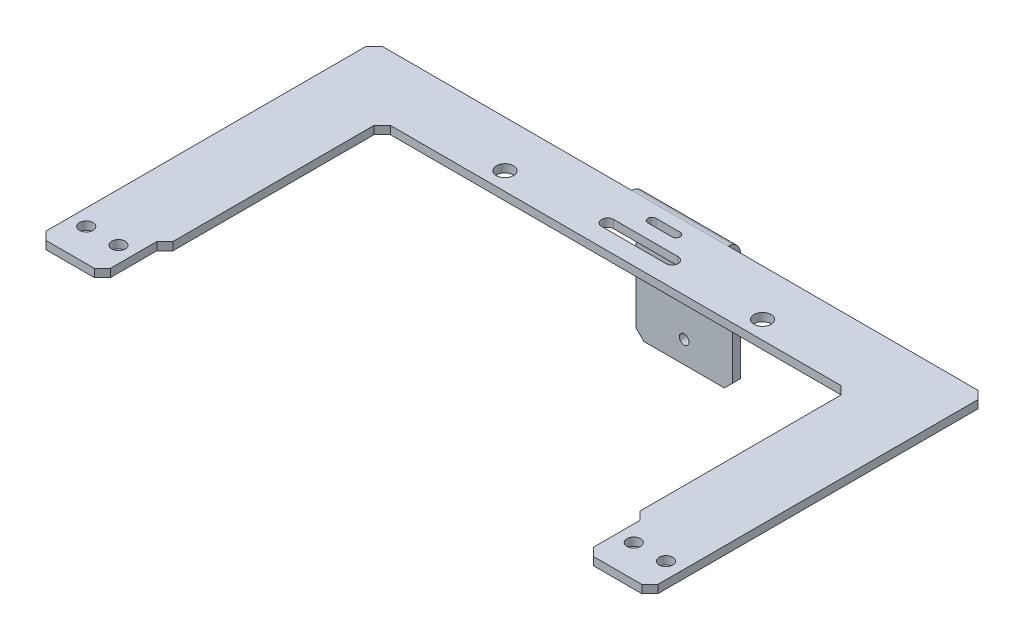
ISO-10303-21;
HEADER;
FILE_DESCRIPTION(('STEP AP214'),'2;1');
FILE_NAME('part.step','',(''),(''),'','','');
FILE_SCHEMA(('AUTOMOTIVE_DESIGN { 1 0 10303 214 1 1 1 1 }'));
ENDSEC;
DATA;
#1=APPLICATION_CONTEXT('core data for automotive mechanical design processes');
#2=APPLICATION_PROTOCOL_DEFINITION('international standard','automotive_design',2000,#1);
#3=PRODUCT_CONTEXT('',#1,'mechanical');
#4=PRODUCT('Part','Part','',(#3));
#5=PRODUCT_RELATED_PRODUCT_CATEGORY('part','',(#4));
#6=PRODUCT_DEFINITION_FORMATION('','',#4);
#7=PRODUCT_DEFINITION_CONTEXT('part definition',#1,'design');
#8=PRODUCT_DEFINITION('design','',#6,#7);
#9=PRODUCT_DEFINITION_SHAPE('','',#8);
#10=(LENGTH_UNIT() NAMED_UNIT(*) SI_UNIT(.MILLI.,.METRE.));
#11=(NAMED_UNIT(*) PLANE_ANGLE_UNIT() SI_UNIT($,.RADIAN.));
#12=(NAMED_UNIT(*) SI_UNIT($,.STERADIAN.) SOLID_ANGLE_UNIT());
#13=UNCERTAINTY_MEASURE_WITH_UNIT(LENGTH_MEASURE(1.E-05),#10,'distance_accuracy_value','');
#14=(GEOMETRIC_REPRESENTATION_CONTEXT(3) GLOBAL_UNCERTAINTY_ASSIGNED_CONTEXT((#13)) GLOBAL_UNIT_ASSIGNED_CONTEXT((#10,
#11,#12)) REPRESENTATION_CONTEXT('',''));
#15=CARTESIAN_POINT('',(0.,0.,0.));
#16=DIRECTION('',(0.,0.,1.));
#17=DIRECTION('',(1.,0.,0.));
#18=AXIS2_PLACEMENT_3D('',#15,#16,#17);
#19=CARTESIAN_POINT('',(0.,3.175,-132.588));
#20=DIRECTION('',(0.,0.,1.));
#21=DIRECTION('',(1.,0.,0.));
#22=AXIS2_PLACEMENT_3D('',#19,#20,#21);
#23=PLANE('',#22);
#24=DIRECTION('',(0.,1.,0.));
#25=VECTOR('',#24,1.);
#26=CARTESIAN_POINT('',(101.6,0.,-132.588));
#27=LINE('',#26,#25);
#28=CARTESIAN_POINT('',(101.6,0.,-132.588));
#29=VERTEX_POINT('',#28);
#30=CARTESIAN_POINT('',(101.6,3.175,-132.588));
#31=VERTEX_POINT('',#30);
#32=EDGE_CURVE('E688',#29,#31,#27,.T.);
#33=ORIENTED_EDGE('',*,*,#32,.F.);
#34=DIRECTION('',(-1.,0.,0.));
#35=VECTOR('',#34,1.);
#36=CARTESIAN_POINT('',(0.,0.,-132.588));
#37=LINE('',#36,#35);
#38=CARTESIAN_POINT('',(3.175,0.,-132.588));
#39=VERTEX_POINT('',#38);
#40=EDGE_CURVE('E27',#29,#39,#37,.T.);
#41=ORIENTED_EDGE('',*,*,#40,.T.);
#42=DIRECTION('',(0.,1.,0.));
#43=VECTOR('',#42,1.);
#44=CARTESIAN_POINT('',(3.175,3.175,-132.588));
#45=LINE('',#44,#43);
#46=CARTESIAN_POINT('',(3.175,3.175,-132.588));
#47=VERTEX_POINT('',#46);
#48=EDGE_CURVE('E704',#39,#47,#45,.T.);
#49=ORIENTED_EDGE('',*,*,#48,.T.);
#50=DIRECTION('',(-1.,0.,0.));
#51=VECTOR('',#50,1.);
#52=CARTESIAN_POINT('',(0.,3.175,-132.588));
#53=LINE('',#52,#51);
#54=EDGE_CURVE('E11',#31,#47,#53,.T.);
#55=ORIENTED_EDGE('',*,*,#54,.F.);
#56=EDGE_LOOP('',(#33,#41,#49,#55));
#57=FACE_BOUND('',#56,.T.);
#58=ADVANCED_FACE('F17',(#57),#23,.F.);
#59=CARTESIAN_POINT('',(0.,3.175,0.));
#60=DIRECTION('',(0.,-1.,0.));
#61=DIRECTION('',(0.,0.,-1.));
#62=AXIS2_PLACEMENT_3D('',#59,#60,#61);
#63=PLANE('',#62);
#64=DIRECTION('',(1.,0.,0.));
#65=VECTOR('',#64,1.);
#66=CARTESIAN_POINT('',(107.95,3.175,-114.33175));
#67=LINE('',#66,#65);
#68=CARTESIAN_POINT('',(107.95,3.175,-114.33175));
#69=VERTEX_POINT('',#68);
#70=CARTESIAN_POINT('',(133.35,3.175,-114.33175));
#71=VERTEX_POINT('',#70);
#72=EDGE_CURVE('E444',#69,#71,#67,.T.);
#73=ORIENTED_EDGE('',*,*,#72,.F.);
#74=CARTESIAN_POINT('',(107.95,3.175,-116.713));
#75=DIRECTION('',(0.,1.,0.));
#76=DIRECTION('',(0.,0.,1.));
#77=AXIS2_PLACEMENT_3D('',#74,#75,#76);
#78=CIRCLE('',#77,2.38125);
#79=CARTESIAN_POINT('',(107.95,3.175,-119.09425));
#80=VERTEX_POINT('',#79);
#81=EDGE_CURVE('E465',#80,#69,#78,.T.);
#82=ORIENTED_EDGE('',*,*,#81,.F.);
#83=DIRECTION('',(-1.,0.,0.));
#84=VECTOR('',#83,1.);
#85=CARTESIAN_POINT('',(107.95,3.175,-119.09425));
#86=LINE('',#85,#84);
#87=CARTESIAN_POINT('',(133.35,3.175,-119.09425));
#88=VERTEX_POINT('',#87);
#89=EDGE_CURVE('E457',#88,#80,#86,.T.);
#90=ORIENTED_EDGE('',*,*,#89,.F.);
#91=CARTESIAN_POINT('',(133.35,3.175,-116.713));
#92=DIRECTION('',(0.,1.,0.));
#93=DIRECTION('',(0.,0.,1.));
#94=AXIS2_PLACEMENT_3D('',#91,#92,#93);
#95=CIRCLE('',#94,2.38125);
#96=EDGE_CURVE('E504',#71,#88,#95,.T.);
#97=ORIENTED_EDGE('',*,*,#96,.F.);
#98=EDGE_LOOP('',(#73,#82,#90,#97));
#99=FACE_BOUND('',#98,.T.);
#100=DIRECTION('',(1.,0.,0.));
#101=VECTOR('',#100,1.);
#102=CARTESIAN_POINT('',(115.8875,3.175,-124.6505));
#103=LINE('',#102,#101);
#104=CARTESIAN_POINT('',(115.8875,3.175,-124.6505));
#105=VERTEX_POINT('',#104);
#106=CARTESIAN_POINT('',(125.4125,3.175,-124.6505));
#107=VERTEX_POINT('',#106);
#108=EDGE_CURVE('E397',#105,#107,#103,.T.);
#109=ORIENTED_EDGE('',*,*,#108,.F.);
#110=CARTESIAN_POINT('',(115.8875,3.175,-126.238));
#111=DIRECTION('',(0.,1.,0.));
#112=DIRECTION('',(0.,0.,1.));
#113=AXIS2_PLACEMENT_3D('',#110,#111,#112);
#114=CIRCLE('',#113,1.5875);
#115=CARTESIAN_POINT('',(115.8875,3.175,-127.8255));
#116=VERTEX_POINT('',#115);
#117=EDGE_CURVE('E599',#116,#105,#114,.T.);
#118=ORIENTED_EDGE('',*,*,#117,.F.);
#119=DIRECTION('',(-1.,0.,0.));
#120=VECTOR('',#119,1.);
#121=CARTESIAN_POINT('',(115.8875,3.175,-127.8255));
#122=LINE('',#121,#120);
#123=CARTESIAN_POINT('',(125.4125,3.175,-127.8255));
#124=VERTEX_POINT('',#123);
#125=EDGE_CURVE('E400',#124,#116,#122,.T.);
#126=ORIENTED_EDGE('',*,*,#125,.F.);
#127=CARTESIAN_POINT('',(125.4125,3.175,-126.238));
#128=DIRECTION('',(0.,1.,0.));
#129=DIRECTION('',(0.,0.,1.));
#130=AXIS2_PLACEMENT_3D('',#127,#128,#129);
#131=CIRCLE('',#130,1.5875);
#132=EDGE_CURVE('E394',#107,#124,#131,.T.);
#133=ORIENTED_EDGE('',*,*,#132,.F.);
#134=EDGE_LOOP('',(#109,#118,#126,#133));
#135=FACE_BOUND('',#134,.T.);
#136=DIRECTION('',(0.,0.,-1.));
#137=VECTOR('',#136,1.);
#138=CARTESIAN_POINT('',(241.3,3.175,0.));
#139=LINE('',#138,#137);
#140=CARTESIAN_POINT('',(241.3,3.175,-3.17500000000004));
#141=VERTEX_POINT('',#140);
#142=CARTESIAN_POINT('',(241.3,3.175,-129.413));
#143=VERTEX_POINT('',#142);
#144=EDGE_CURVE('E550',#141,#143,#139,.T.);
#145=ORIENTED_EDGE('',*,*,#144,.T.);
#146=DIRECTION('',(-0.707106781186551,0.,-0.707106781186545));
#147=VECTOR('',#146,1.);
#148=CARTESIAN_POINT('',(238.125,3.175,-132.588));
#149=LINE('',#148,#147);
#150=CARTESIAN_POINT('',(238.125,3.175,-132.588));
#151=VERTEX_POINT('',#150);
#152=EDGE_CURVE('E712',#143,#151,#149,.T.);
#153=ORIENTED_EDGE('',*,*,#152,.T.);
#154=DIRECTION('',(-1.,0.,0.));
#155=VECTOR('',#154,1.);
#156=CARTESIAN_POINT('',(0.,3.175,-132.588));
#157=LINE('',#156,#155);
#158=CARTESIAN_POINT('',(139.7,3.175,-132.588));
#159=VERTEX_POINT('',#158);
#160=EDGE_CURVE('E814',#151,#159,#157,.T.);
#161=ORIENTED_EDGE('',*,*,#160,.T.);
#162=DIRECTION('',(-1.,0.,0.));
#163=VECTOR('',#162,1.);
#164=CARTESIAN_POINT('',(139.7,3.175,-132.588));
#165=LINE('',#164,#163);
#166=EDGE_CURVE('E678',#159,#31,#165,.T.);
#167=ORIENTED_EDGE('',*,*,#166,.T.);
#168=ORIENTED_EDGE('',*,*,#54,.T.);
#169=DIRECTION('',(-0.707106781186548,0.,0.707106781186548));
#170=VECTOR('',#169,1.);
#171=CARTESIAN_POINT('',(0.,3.175,-129.413));
#172=LINE('',#171,#170);
#173=CARTESIAN_POINT('',(0.,3.175,-129.413));
#174=VERTEX_POINT('',#173);
#175=EDGE_CURVE('E692',#47,#174,#172,.T.);
#176=ORIENTED_EDGE('',*,*,#175,.T.);
#177=DIRECTION('',(0.,0.,1.));
#178=VECTOR('',#177,1.);
#179=CARTESIAN_POINT('',(0.,3.175,0.));
#180=LINE('',#179,#178);
#181=CARTESIAN_POINT('',(0.,3.175,-3.175));
#182=VERTEX_POINT('',#181);
#183=EDGE_CURVE('E695',#174,#182,#180,.T.);
#184=ORIENTED_EDGE('',*,*,#183,.T.);
#185=DIRECTION('',(0.707106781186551,0.,0.707106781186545));
#186=VECTOR('',#185,1.);
#187=CARTESIAN_POINT('',(3.17500000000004,3.175,0.));
#188=LINE('',#187,#186);
#189=CARTESIAN_POINT('',(3.17500000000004,3.175,0.));
#190=VERTEX_POINT('',#189);
#191=EDGE_CURVE('E725',#182,#190,#188,.T.);
#192=ORIENTED_EDGE('',*,*,#191,.T.);
#193=DIRECTION('',(1.,0.,0.));
#194=VECTOR('',#193,1.);
#195=CARTESIAN_POINT('',(25.4,3.175,0.));
#196=LINE('',#195,#194);
#197=CARTESIAN_POINT('',(22.225,3.175,0.));
#198=VERTEX_POINT('',#197);
#199=EDGE_CURVE('E746',#190,#198,#196,.T.);
#200=ORIENTED_EDGE('',*,*,#199,.T.);
#201=DIRECTION('',(0.707106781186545,0.,-0.707106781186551));
#202=VECTOR('',#201,1.);
#203=CARTESIAN_POINT('',(25.4,3.175,-3.17500000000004));
#204=LINE('',#203,#202);
#205=CARTESIAN_POINT('',(25.4,3.175,-3.17500000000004));
#206=VERTEX_POINT('',#205);
#207=EDGE_CURVE('E430',#198,#206,#204,.T.);
#208=ORIENTED_EDGE('',*,*,#207,.T.);
#209=DIRECTION('',(0.,0.,-1.));
#210=VECTOR('',#209,1.);
#211=CARTESIAN_POINT('',(25.4,3.175,0.));
#212=LINE('',#211,#210);
#213=CARTESIAN_POINT('',(25.4,3.175,-21.463));
#214=VERTEX_POINT('',#213);
#215=EDGE_CURVE('E40',#206,#214,#212,.T.);
#216=ORIENTED_EDGE('',*,*,#215,.T.);
#217=DIRECTION('',(0.707106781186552,0.,-0.707106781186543));
#218=VECTOR('',#217,1.);
#219=CARTESIAN_POINT('',(25.4,3.175,-21.463));
#220=LINE('',#219,#218);
#221=CARTESIAN_POINT('',(28.575,3.175,-24.638));
#222=VERTEX_POINT('',#221);
#223=EDGE_CURVE('E545',#214,#222,#220,.T.);
#224=ORIENTED_EDGE('',*,*,#223,.T.);
#225=DIRECTION('',(0.,0.,-1.));
#226=VECTOR('',#225,1.);
#227=CARTESIAN_POINT('',(28.575,3.175,-24.638));
#228=LINE('',#227,#226);
#229=CARTESIAN_POINT('',(28.575,3.175,-104.013));
#230=VERTEX_POINT('',#229);
#231=EDGE_CURVE('E759',#222,#230,#228,.T.);
#232=ORIENTED_EDGE('',*,*,#231,.T.);
#233=DIRECTION('',(0.707106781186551,0.,-0.707106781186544));
#234=VECTOR('',#233,1.);
#235=CARTESIAN_POINT('',(-37.719,3.175,-37.7190000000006));
#236=LINE('',#235,#234);
#237=CARTESIAN_POINT('',(31.75,3.175,-107.188));
#238=VERTEX_POINT('',#237);
#239=EDGE_CURVE('E516',#230,#238,#236,.T.);
#240=ORIENTED_EDGE('',*,*,#239,.T.);
#241=DIRECTION('',(1.,0.,0.));
#242=VECTOR('',#241,1.);
#243=CARTESIAN_POINT('',(28.575,3.175,-107.188));
#244=LINE('',#243,#242);
#245=CARTESIAN_POINT('',(209.55,3.175,-107.188));
#246=VERTEX_POINT('',#245);
#247=EDGE_CURVE('E469',#238,#246,#244,.T.);
#248=ORIENTED_EDGE('',*,*,#247,.T.);
#249=DIRECTION('',(0.707106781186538,0.,0.707106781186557));
#250=VECTOR('',#249,1.);
#251=CARTESIAN_POINT('',(158.369000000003,3.175,-158.369));
#252=LINE('',#251,#250);
#253=CARTESIAN_POINT('',(212.725,3.175,-104.013));
#254=VERTEX_POINT('',#253);
#255=EDGE_CURVE('E721',#246,#254,#252,.T.);
#256=ORIENTED_EDGE('',*,*,#255,.T.);
#257=DIRECTION('',(0.,0.,1.));
#258=VECTOR('',#257,1.);
#259=CARTESIAN_POINT('',(212.725,3.175,-24.638));
#260=LINE('',#259,#258);
#261=CARTESIAN_POINT('',(212.725,3.175,-24.638));
#262=VERTEX_POINT('',#261);
#263=EDGE_CURVE('E573',#254,#262,#260,.T.);
#264=ORIENTED_EDGE('',*,*,#263,.T.);
#265=DIRECTION('',(0.70710678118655,0.,0.707106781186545));
#266=VECTOR('',#265,1.);
#267=CARTESIAN_POINT('',(215.9,3.175,-21.463));
#268=LINE('',#267,#266);
#269=CARTESIAN_POINT('',(215.9,3.175,-21.463));
#270=VERTEX_POINT('',#269);
#271=EDGE_CURVE('E494',#262,#270,#268,.T.);
#272=ORIENTED_EDGE('',*,*,#271,.T.);
#273=DIRECTION('',(0.,0.,1.));
#274=VECTOR('',#273,1.);
#275=CARTESIAN_POINT('',(215.9,3.175,0.));
#276=LINE('',#275,#274);
#277=CARTESIAN_POINT('',(215.9,3.175,-3.175));
#278=VERTEX_POINT('',#277);
#279=EDGE_CURVE('E578',#270,#278,#276,.T.);
#280=ORIENTED_EDGE('',*,*,#279,.T.);
#281=DIRECTION('',(0.707106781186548,0.,0.707106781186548));
#282=VECTOR('',#281,1.);
#283=CARTESIAN_POINT('',(219.075,3.175,0.));
#284=LINE('',#283,#282);
#285=CARTESIAN_POINT('',(219.075,3.175,0.));
#286=VERTEX_POINT('',#285);
#287=EDGE_CURVE('E670',#278,#286,#284,.T.);
#288=ORIENTED_EDGE('',*,*,#287,.T.);
#289=DIRECTION('',(1.,0.,0.));
#290=VECTOR('',#289,1.);
#291=CARTESIAN_POINT('',(215.9,3.175,0.));
#292=LINE('',#291,#290);
#293=CARTESIAN_POINT('',(238.125,3.175,0.));
#294=VERTEX_POINT('',#293);
#295=EDGE_CURVE('E446',#286,#294,#292,.T.);
#296=ORIENTED_EDGE('',*,*,#295,.T.);
#297=DIRECTION('',(0.707106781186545,0.,-0.707106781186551));
#298=VECTOR('',#297,1.);
#299=CARTESIAN_POINT('',(241.3,3.175,-3.17500000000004));
#300=LINE('',#299,#298);
#301=EDGE_CURVE('E591',#294,#141,#300,.T.);
#302=ORIENTED_EDGE('',*,*,#301,.T.);
#303=EDGE_LOOP('',(#145,#153,#161,#167,#168,#176,#184,#192,#200,#208,#216,#224,#232,#240,#248,
#256,#264,#272,#280,#288,#296,#302));
#304=FACE_BOUND('',#303,.T.);
#305=CARTESIAN_POINT('',(6.35,3.175,-12.7));
#306=DIRECTION('',(0.,1.,0.));
#307=DIRECTION('',(0.,0.,1.));
#308=AXIS2_PLACEMENT_3D('',#305,#306,#307);
#309=CIRCLE('',#308,2.667);
#310=CARTESIAN_POINT('',(6.35,3.175,-10.033));
#311=VERTEX_POINT('',#310);
#312=EDGE_CURVE('E557',#311,#311,#309,.T.);
#313=ORIENTED_EDGE('',*,*,#312,.F.);
#314=EDGE_LOOP('',(#313));
#315=FACE_BOUND('',#314,.T.);
#316=CARTESIAN_POINT('',(19.05,3.175,-12.7));
#317=DIRECTION('',(0.,1.,0.));
#318=DIRECTION('',(0.,0.,1.));
#319=AXIS2_PLACEMENT_3D('',#316,#317,#318);
#320=CIRCLE('',#319,2.667);
#321=CARTESIAN_POINT('',(19.05,3.175,-10.033));
#322=VERTEX_POINT('',#321);
#323=EDGE_CURVE('E558',#322,#322,#320,.T.);
#324=ORIENTED_EDGE('',*,*,#323,.F.);
#325=EDGE_LOOP('',(#324));
#326=FACE_BOUND('',#325,.T.);
#327=CARTESIAN_POINT('',(69.85,3.175,-114.3));
#328=DIRECTION('',(0.,1.,0.));
#329=DIRECTION('',(0.,0.,1.));
#330=AXIS2_PLACEMENT_3D('',#327,#328,#329);
#331=CIRCLE('',#330,3.3782);
#332=CARTESIAN_POINT('',(69.85,3.175,-110.9218));
#333=VERTEX_POINT('',#332);
#334=EDGE_CURVE('E476',#333,#333,#331,.T.);
#335=ORIENTED_EDGE('',*,*,#334,.F.);
#336=EDGE_LOOP('',(#335));
#337=FACE_BOUND('',#336,.T.);
#338=CARTESIAN_POINT('',(222.25,3.175,-12.7));
#339=DIRECTION('',(0.,1.,0.));
#340=DIRECTION('',(0.,0.,-1.));
#341=AXIS2_PLACEMENT_3D('',#338,#339,#340);
#342=CIRCLE('',#341,2.667);
#343=CARTESIAN_POINT('',(222.25,3.175,-15.367));
#344=VERTEX_POINT('',#343);
#345=EDGE_CURVE('E659',#344,#344,#342,.T.);
#346=ORIENTED_EDGE('',*,*,#345,.F.);
#347=EDGE_LOOP('',(#346));
#348=FACE_BOUND('',#347,.T.);
#349=CARTESIAN_POINT('',(234.95,3.175,-12.7));
#350=DIRECTION('',(0.,1.,0.));
#351=DIRECTION('',(0.,0.,-1.));
#352=AXIS2_PLACEMENT_3D('',#349,#350,#351);
#353=CIRCLE('',#352,2.667);
#354=CARTESIAN_POINT('',(234.95,3.175,-15.367));
#355=VERTEX_POINT('',#354);
#356=EDGE_CURVE('E797',#355,#355,#353,.T.);
#357=ORIENTED_EDGE('',*,*,#356,.F.);
#358=EDGE_LOOP('',(#357));
#359=FACE_BOUND('',#358,.T.);
#360=CARTESIAN_POINT('',(171.45,3.175,-114.3));
#361=DIRECTION('',(0.,1.,0.));
#362=DIRECTION('',(0.,0.,-1.));
#363=AXIS2_PLACEMENT_3D('',#360,#361,#362);
#364=CIRCLE('',#363,3.3782);
#365=CARTESIAN_POINT('',(171.45,3.175,-117.6782));
#366=VERTEX_POINT('',#365);
#367=EDGE_CURVE('E652',#366,#366,#364,.T.);
#368=ORIENTED_EDGE('',*,*,#367,.F.);
#369=EDGE_LOOP('',(#368));
#370=FACE_BOUND('',#369,.T.);
#371=ADVANCED_FACE('F19',(#99,#135,#304,#315,#326,#337,#348,#359,#370),#63,.F.);
#372=CARTESIAN_POINT('',(0.,0.,0.));
#373=DIRECTION('',(0.,-1.,0.));
#374=DIRECTION('',(0.,0.,-1.));
#375=AXIS2_PLACEMENT_3D('',#372,#373,#374);
#376=PLANE('',#375);
#377=CARTESIAN_POINT('',(107.95,0.,-116.713));
#378=DIRECTION('',(0.,-1.,0.));
#379=DIRECTION('',(0.,0.,-1.));
#380=AXIS2_PLACEMENT_3D('',#377,#378,#379);
#381=CIRCLE('',#380,2.38125);
#382=CARTESIAN_POINT('',(107.95,0.,-114.33175));
#383=VERTEX_POINT('',#382);
#384=CARTESIAN_POINT('',(107.95,0.,-119.09425));
#385=VERTEX_POINT('',#384);
#386=EDGE_CURVE('E474',#383,#385,#381,.T.);
#387=ORIENTED_EDGE('',*,*,#386,.F.);
#388=DIRECTION('',(-1.,0.,0.));
#389=VECTOR('',#388,1.);
#390=CARTESIAN_POINT('',(0.,0.,-114.33175));
#391=LINE('',#390,#389);
#392=CARTESIAN_POINT('',(133.35,0.,-114.33175));
#393=VERTEX_POINT('',#392);
#394=EDGE_CURVE('E445',#393,#383,#391,.T.);
#395=ORIENTED_EDGE('',*,*,#394,.F.);
#396=CARTESIAN_POINT('',(133.35,0.,-116.713));
#397=DIRECTION('',(0.,-1.,0.));
#398=DIRECTION('',(0.,0.,-1.));
#399=AXIS2_PLACEMENT_3D('',#396,#397,#398);
#400=CIRCLE('',#399,2.38125);
#401=CARTESIAN_POINT('',(133.35,0.,-119.09425));
#402=VERTEX_POINT('',#401);
#403=EDGE_CURVE('E490',#402,#393,#400,.T.);
#404=ORIENTED_EDGE('',*,*,#403,.F.);
#405=DIRECTION('',(1.,0.,0.));
#406=VECTOR('',#405,1.);
#407=CARTESIAN_POINT('',(0.,0.,-119.09425));
#408=LINE('',#407,#406);
#409=EDGE_CURVE('E454',#385,#402,#408,.T.);
#410=ORIENTED_EDGE('',*,*,#409,.F.);
#411=EDGE_LOOP('',(#387,#395,#404,#410));
#412=FACE_BOUND('',#411,.T.);
#413=CARTESIAN_POINT('',(115.8875,0.,-126.238));
#414=DIRECTION('',(0.,-1.,0.));
#415=DIRECTION('',(0.,0.,-1.));
#416=AXIS2_PLACEMENT_3D('',#413,#414,#415);
#417=CIRCLE('',#416,1.5875);
#418=CARTESIAN_POINT('',(115.8875,0.,-124.6505));
#419=VERTEX_POINT('',#418);
#420=CARTESIAN_POINT('',(115.8875,0.,-127.8255));
#421=VERTEX_POINT('',#420);
#422=EDGE_CURVE('E590',#419,#421,#417,.T.);
#423=ORIENTED_EDGE('',*,*,#422,.F.);
#424=DIRECTION('',(-1.,0.,0.));
#425=VECTOR('',#424,1.);
#426=CARTESIAN_POINT('',(0.,0.,-124.6505));
#427=LINE('',#426,#425);
#428=CARTESIAN_POINT('',(125.4125,0.,-124.6505));
#429=VERTEX_POINT('',#428);
#430=EDGE_CURVE('E426',#429,#419,#427,.T.);
#431=ORIENTED_EDGE('',*,*,#430,.F.);
#432=CARTESIAN_POINT('',(125.4125,0.,-126.238));
#433=DIRECTION('',(0.,-1.,0.));
#434=DIRECTION('',(0.,0.,-1.));
#435=AXIS2_PLACEMENT_3D('',#432,#433,#434);
#436=CIRCLE('',#435,1.5875);
#437=CARTESIAN_POINT('',(125.4125,0.,-127.8255));
#438=VERTEX_POINT('',#437);
#439=EDGE_CURVE('E406',#438,#429,#436,.T.);
#440=ORIENTED_EDGE('',*,*,#439,.F.);
#441=DIRECTION('',(1.,0.,0.));
#442=VECTOR('',#441,1.);
#443=CARTESIAN_POINT('',(0.,0.,-127.8255));
#444=LINE('',#443,#442);
#445=EDGE_CURVE('E567',#421,#438,#444,.T.);
#446=ORIENTED_EDGE('',*,*,#445,.F.);
#447=EDGE_LOOP('',(#423,#431,#440,#446));
#448=FACE_BOUND('',#447,.T.);
#449=CARTESIAN_POINT('',(234.95,0.,-12.7));
#450=DIRECTION('',(0.,1.,0.));
#451=DIRECTION('',(0.,0.,-1.));
#452=AXIS2_PLACEMENT_3D('',#449,#450,#451);
#453=CIRCLE('',#452,2.667);
#454=CARTESIAN_POINT('',(234.95,0.,-15.367));
#455=VERTEX_POINT('',#454);
#456=EDGE_CURVE('E778',#455,#455,#453,.T.);
#457=ORIENTED_EDGE('',*,*,#456,.T.);
#458=EDGE_LOOP('',(#457));
#459=FACE_BOUND('',#458,.T.);
#460=CARTESIAN_POINT('',(69.85,0.,-114.3));
#461=DIRECTION('',(0.,1.,0.));
#462=DIRECTION('',(0.,0.,1.));
#463=AXIS2_PLACEMENT_3D('',#460,#461,#462);
#464=CIRCLE('',#463,3.3782);
#465=CARTESIAN_POINT('',(69.85,0.,-110.9218));
#466=VERTEX_POINT('',#465);
#467=EDGE_CURVE('E480',#466,#466,#464,.T.);
#468=ORIENTED_EDGE('',*,*,#467,.T.);
#469=EDGE_LOOP('',(#468));
#470=FACE_BOUND('',#469,.T.);
#471=CARTESIAN_POINT('',(6.35,0.,-12.7));
#472=DIRECTION('',(0.,1.,0.));
#473=DIRECTION('',(0.,0.,1.));
#474=AXIS2_PLACEMENT_3D('',#471,#472,#473);
#475=CIRCLE('',#474,2.667);
#476=CARTESIAN_POINT('',(6.35,0.,-10.033));
#477=VERTEX_POINT('',#476);
#478=EDGE_CURVE('E554',#477,#477,#475,.T.);
#479=ORIENTED_EDGE('',*,*,#478,.T.);
#480=EDGE_LOOP('',(#479));
#481=FACE_BOUND('',#480,.T.);
#482=DIRECTION('',(-1.,0.,0.));
#483=VECTOR('',#482,1.);
#484=CARTESIAN_POINT('',(0.,0.,-132.588));
#485=LINE('',#484,#483);
#486=CARTESIAN_POINT('',(238.125,0.,-132.588));
#487=VERTEX_POINT('',#486);
#488=CARTESIAN_POINT('',(139.7,0.,-132.588));
#489=VERTEX_POINT('',#488);
#490=EDGE_CURVE('E811',#487,#489,#485,.T.);
#491=ORIENTED_EDGE('',*,*,#490,.F.);
#492=DIRECTION('',(0.707106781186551,0.,0.707106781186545));
#493=VECTOR('',#492,1.);
#494=CARTESIAN_POINT('',(185.3565,0.,-185.3565));
#495=LINE('',#494,#493);
#496=CARTESIAN_POINT('',(241.3,0.,-129.413));
#497=VERTEX_POINT('',#496);
#498=EDGE_CURVE('E486',#487,#497,#495,.T.);
#499=ORIENTED_EDGE('',*,*,#498,.T.);
#500=DIRECTION('',(0.,0.,-1.));
#501=VECTOR('',#500,1.);
#502=CARTESIAN_POINT('',(241.3,0.,0.));
#503=LINE('',#502,#501);
#504=CARTESIAN_POINT('',(241.3,0.,-3.175));
#505=VERTEX_POINT('',#504);
#506=EDGE_CURVE('E553',#505,#497,#503,.T.);
#507=ORIENTED_EDGE('',*,*,#506,.F.);
#508=DIRECTION('',(-0.707106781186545,0.,0.707106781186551));
#509=VECTOR('',#508,1.);
#510=CARTESIAN_POINT('',(119.0625,0.,119.0625));
#511=LINE('',#510,#509);
#512=CARTESIAN_POINT('',(238.125,0.,0.));
#513=VERTEX_POINT('',#512);
#514=EDGE_CURVE('E696',#505,#513,#511,.T.);
#515=ORIENTED_EDGE('',*,*,#514,.T.);
#516=DIRECTION('',(1.,0.,0.));
#517=VECTOR('',#516,1.);
#518=CARTESIAN_POINT('',(215.9,0.,0.));
#519=LINE('',#518,#517);
#520=CARTESIAN_POINT('',(219.075,0.,0.));
#521=VERTEX_POINT('',#520);
#522=EDGE_CURVE('E450',#521,#513,#519,.T.);
#523=ORIENTED_EDGE('',*,*,#522,.F.);
#524=DIRECTION('',(-0.707106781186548,0.,-0.707106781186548));
#525=VECTOR('',#524,1.);
#526=CARTESIAN_POINT('',(109.5375,0.,-109.5375));
#527=LINE('',#526,#525);
#528=CARTESIAN_POINT('',(215.9,0.,-3.175));
#529=VERTEX_POINT('',#528);
#530=EDGE_CURVE('E782',#521,#529,#527,.T.);
#531=ORIENTED_EDGE('',*,*,#530,.T.);
#532=DIRECTION('',(0.,0.,1.));
#533=VECTOR('',#532,1.);
#534=CARTESIAN_POINT('',(215.9,0.,0.));
#535=LINE('',#534,#533);
#536=CARTESIAN_POINT('',(215.9,0.,-21.463));
#537=VERTEX_POINT('',#536);
#538=EDGE_CURVE('E449',#537,#529,#535,.T.);
#539=ORIENTED_EDGE('',*,*,#538,.F.);
#540=DIRECTION('',(0.70710678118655,0.,0.707106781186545));
#541=VECTOR('',#540,1.);
#542=CARTESIAN_POINT('',(215.9,0.,-21.463));
#543=LINE('',#542,#541);
#544=CARTESIAN_POINT('',(212.725,0.,-24.638));
#545=VERTEX_POINT('',#544);
#546=EDGE_CURVE('E491',#545,#537,#543,.T.);
#547=ORIENTED_EDGE('',*,*,#546,.F.);
#548=DIRECTION('',(0.,0.,1.));
#549=VECTOR('',#548,1.);
#550=CARTESIAN_POINT('',(212.725,0.,-24.638));
#551=LINE('',#550,#549);
#552=CARTESIAN_POINT('',(212.725,0.,-104.013));
#553=VERTEX_POINT('',#552);
#554=EDGE_CURVE('E470',#553,#545,#551,.T.);
#555=ORIENTED_EDGE('',*,*,#554,.F.);
#556=DIRECTION('',(-0.707106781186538,0.,-0.707106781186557));
#557=VECTOR('',#556,1.);
#558=CARTESIAN_POINT('',(212.725,0.,-104.013));
#559=LINE('',#558,#557);
#560=CARTESIAN_POINT('',(209.55,0.,-107.188));
#561=VERTEX_POINT('',#560);
#562=EDGE_CURVE('E671',#553,#561,#559,.T.);
#563=ORIENTED_EDGE('',*,*,#562,.T.);
#564=DIRECTION('',(1.,0.,0.));
#565=VECTOR('',#564,1.);
#566=CARTESIAN_POINT('',(28.575,0.,-107.188));
#567=LINE('',#566,#565);
#568=CARTESIAN_POINT('',(31.75,0.,-107.188));
#569=VERTEX_POINT('',#568);
#570=EDGE_CURVE('E466',#569,#561,#567,.T.);
#571=ORIENTED_EDGE('',*,*,#570,.F.);
#572=DIRECTION('',(-0.707106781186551,0.,0.707106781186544));
#573=VECTOR('',#572,1.);
#574=CARTESIAN_POINT('',(31.75,0.,-107.188));
#575=LINE('',#574,#573);
#576=CARTESIAN_POINT('',(28.575,0.,-104.013));
#577=VERTEX_POINT('',#576);
#578=EDGE_CURVE('E515',#569,#577,#575,.T.);
#579=ORIENTED_EDGE('',*,*,#578,.T.);
#580=DIRECTION('',(0.,0.,-1.));
#581=VECTOR('',#580,1.);
#582=CARTESIAN_POINT('',(28.575,0.,-24.638));
#583=LINE('',#582,#581);
#584=CARTESIAN_POINT('',(28.575,0.,-24.638));
#585=VERTEX_POINT('',#584);
#586=EDGE_CURVE('E771',#585,#577,#583,.T.);
#587=ORIENTED_EDGE('',*,*,#586,.F.);
#588=DIRECTION('',(0.707106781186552,0.,-0.707106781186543));
#589=VECTOR('',#588,1.);
#590=CARTESIAN_POINT('',(25.4,0.,-21.463));
#591=LINE('',#590,#589);
#592=CARTESIAN_POINT('',(25.4,0.,-21.463));
#593=VERTEX_POINT('',#592);
#594=EDGE_CURVE('E549',#593,#585,#591,.T.);
#595=ORIENTED_EDGE('',*,*,#594,.F.);
#596=DIRECTION('',(0.,0.,-1.));
#597=VECTOR('',#596,1.);
#598=CARTESIAN_POINT('',(25.4,0.,0.));
#599=LINE('',#598,#597);
#600=CARTESIAN_POINT('',(25.4,0.,-3.17500000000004));
#601=VERTEX_POINT('',#600);
#602=EDGE_CURVE('E49',#601,#593,#599,.T.);
#603=ORIENTED_EDGE('',*,*,#602,.F.);
#604=DIRECTION('',(-0.707106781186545,0.,0.707106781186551));
#605=VECTOR('',#604,1.);
#606=CARTESIAN_POINT('',(11.1125,0.,11.1125));
#607=LINE('',#606,#605);
#608=CARTESIAN_POINT('',(22.225,0.,0.));
#609=VERTEX_POINT('',#608);
#610=EDGE_CURVE('E537',#601,#609,#607,.T.);
#611=ORIENTED_EDGE('',*,*,#610,.T.);
#612=DIRECTION('',(1.,0.,0.));
#613=VECTOR('',#612,1.);
#614=CARTESIAN_POINT('',(25.4,0.,0.));
#615=LINE('',#614,#613);
#616=CARTESIAN_POINT('',(3.17500000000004,0.,0.));
#617=VERTEX_POINT('',#616);
#618=EDGE_CURVE('E614',#617,#609,#615,.T.);
#619=ORIENTED_EDGE('',*,*,#618,.F.);
#620=DIRECTION('',(-0.707106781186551,0.,-0.707106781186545));
#621=VECTOR('',#620,1.);
#622=CARTESIAN_POINT('',(1.5875,0.,-1.5875));
#623=LINE('',#622,#621);
#624=CARTESIAN_POINT('',(0.,0.,-3.175));
#625=VERTEX_POINT('',#624);
#626=EDGE_CURVE('E736',#617,#625,#623,.T.);
#627=ORIENTED_EDGE('',*,*,#626,.T.);
#628=DIRECTION('',(0.,0.,1.));
#629=VECTOR('',#628,1.);
#630=CARTESIAN_POINT('',(0.,0.,0.));
#631=LINE('',#630,#629);
#632=CARTESIAN_POINT('',(0.,0.,-129.413));
#633=VERTEX_POINT('',#632);
#634=EDGE_CURVE('E21',#633,#625,#631,.T.);
#635=ORIENTED_EDGE('',*,*,#634,.F.);
#636=DIRECTION('',(0.707106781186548,0.,-0.707106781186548));
#637=VECTOR('',#636,1.);
#638=CARTESIAN_POINT('',(-64.7065,0.,-64.7065));
#639=LINE('',#638,#637);
#640=EDGE_CURVE('E708',#633,#39,#639,.T.);
#641=ORIENTED_EDGE('',*,*,#640,.T.);
#642=ORIENTED_EDGE('',*,*,#40,.F.);
#643=DIRECTION('',(-1.,0.,0.));
#644=VECTOR('',#643,1.);
#645=CARTESIAN_POINT('',(139.7,0.,-132.588));
#646=LINE('',#645,#644);
#647=EDGE_CURVE('E559',#489,#29,#646,.T.);
#648=ORIENTED_EDGE('',*,*,#647,.F.);
#649=EDGE_LOOP('',(#491,#499,#507,#515,#523,#531,#539,#547,#555,#563,#571,#579,#587,#595,#603,
#611,#619,#627,#635,#641,#642,#648));
#650=FACE_BOUND('',#649,.T.);
#651=CARTESIAN_POINT('',(19.05,0.,-12.7));
#652=DIRECTION('',(0.,1.,0.));
#653=DIRECTION('',(0.,0.,1.));
#654=AXIS2_PLACEMENT_3D('',#651,#652,#653);
#655=CIRCLE('',#654,2.667);
#656=CARTESIAN_POINT('',(19.05,0.,-10.033));
#657=VERTEX_POINT('',#656);
#658=EDGE_CURVE('E479',#657,#657,#655,.T.);
#659=ORIENTED_EDGE('',*,*,#658,.T.);
#660=EDGE_LOOP('',(#659));
#661=FACE_BOUND('',#660,.T.);
#662=CARTESIAN_POINT('',(222.25,0.,-12.7));
#663=DIRECTION('',(0.,1.,0.));
#664=DIRECTION('',(0.,0.,-1.));
#665=AXIS2_PLACEMENT_3D('',#662,#663,#664);
#666=CIRCLE('',#665,2.667);
#667=CARTESIAN_POINT('',(222.25,0.,-15.367));
#668=VERTEX_POINT('',#667);
#669=EDGE_CURVE('E800',#668,#668,#666,.T.);
#670=ORIENTED_EDGE('',*,*,#669,.T.);
#671=EDGE_LOOP('',(#670));
#672=FACE_BOUND('',#671,.T.);
#673=CARTESIAN_POINT('',(171.45,0.,-114.3));
#674=DIRECTION('',(0.,1.,0.));
#675=DIRECTION('',(0.,0.,-1.));
#676=AXIS2_PLACEMENT_3D('',#673,#674,#675);
#677=CIRCLE('',#676,3.3782);
#678=CARTESIAN_POINT('',(171.45,0.,-117.6782));
#679=VERTEX_POINT('',#678);
#680=EDGE_CURVE('E485',#679,#679,#677,.T.);
#681=ORIENTED_EDGE('',*,*,#680,.T.);
#682=EDGE_LOOP('',(#681));
#683=FACE_BOUND('',#682,.T.);
#684=ADVANCED_FACE('F850',(#412,#448,#459,#470,#481,#650,#661,#672,#683),#376,.T.);
#685=CARTESIAN_POINT('',(0.,3.175,0.));
#686=DIRECTION('',(1.,0.,0.));
#687=DIRECTION('',(0.,1.,0.));
#688=AXIS2_PLACEMENT_3D('',#685,#686,#687);
#689=PLANE('',#688);
#690=ORIENTED_EDGE('',*,*,#634,.T.);
#691=DIRECTION('',(0.,1.,0.));
#692=VECTOR('',#691,1.);
#693=CARTESIAN_POINT('',(0.,3.175,-3.175));
#694=LINE('',#693,#692);
#695=EDGE_CURVE('E732',#625,#182,#694,.T.);
#696=ORIENTED_EDGE('',*,*,#695,.T.);
#697=ORIENTED_EDGE('',*,*,#183,.F.);
#698=DIRECTION('',(0.,-1.,0.));
#699=VECTOR('',#698,1.);
#700=CARTESIAN_POINT('',(0.,3.175,-129.413));
#701=LINE('',#700,#699);
#702=EDGE_CURVE('E716',#174,#633,#701,.T.);
#703=ORIENTED_EDGE('',*,*,#702,.T.);
#704=EDGE_LOOP('',(#690,#696,#697,#703));
#705=FACE_BOUND('',#704,.T.);
#706=ADVANCED_FACE('F843',(#705),#689,.F.);
#707=CARTESIAN_POINT('',(25.4,3.175,0.));
#708=DIRECTION('',(0.,0.,-1.));
#709=DIRECTION('',(0.,-1.,0.));
#710=AXIS2_PLACEMENT_3D('',#707,#708,#709);
#711=PLANE('',#710);
#712=ORIENTED_EDGE('',*,*,#618,.T.);
#713=DIRECTION('',(0.,1.,0.));
#714=VECTOR('',#713,1.);
#715=CARTESIAN_POINT('',(22.225,3.175,0.));
#716=LINE('',#715,#714);
#717=EDGE_CURVE('E432',#609,#198,#716,.T.);
#718=ORIENTED_EDGE('',*,*,#717,.T.);
#719=ORIENTED_EDGE('',*,*,#199,.F.);
#720=DIRECTION('',(0.,-1.,0.));
#721=VECTOR('',#720,1.);
#722=CARTESIAN_POINT('',(3.17500000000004,3.175,0.));
#723=LINE('',#722,#721);
#724=EDGE_CURVE('E433',#190,#617,#723,.T.);
#725=ORIENTED_EDGE('',*,*,#724,.T.);
#726=EDGE_LOOP('',(#712,#718,#719,#725));
#727=FACE_BOUND('',#726,.T.);
#728=ADVANCED_FACE('F943',(#727),#711,.F.);
#729=CARTESIAN_POINT('',(25.4,3.175,0.));
#730=DIRECTION('',(-1.,0.,0.));
#731=DIRECTION('',(0.,0.,1.));
#732=AXIS2_PLACEMENT_3D('',#729,#730,#731);
#733=PLANE('',#732);
#734=ORIENTED_EDGE('',*,*,#215,.F.);
#735=DIRECTION('',(0.,-1.,0.));
#736=VECTOR('',#735,1.);
#737=CARTESIAN_POINT('',(25.4,3.175,-3.17500000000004));
#738=LINE('',#737,#736);
#739=EDGE_CURVE('E740',#206,#601,#738,.T.);
#740=ORIENTED_EDGE('',*,*,#739,.T.);
#741=ORIENTED_EDGE('',*,*,#602,.T.);
#742=DIRECTION('',(0.,-1.,0.));
#743=VECTOR('',#742,1.);
#744=CARTESIAN_POINT('',(25.4,3.175,-21.463));
#745=LINE('',#744,#743);
#746=EDGE_CURVE('E548',#214,#593,#745,.T.);
#747=ORIENTED_EDGE('',*,*,#746,.F.);
#748=EDGE_LOOP('',(#734,#740,#741,#747));
#749=FACE_BOUND('',#748,.T.);
#750=ADVANCED_FACE('F935',(#749),#733,.F.);
#751=CARTESIAN_POINT('',(25.4,3.175,-21.463));
#752=DIRECTION('',(-0.707106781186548,0.,-0.707106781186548));
#753=DIRECTION('',(-0.707106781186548,0.,0.707106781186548));
#754=AXIS2_PLACEMENT_3D('',#751,#752,#753);
#755=PLANE('',#754);
#756=ORIENTED_EDGE('',*,*,#594,.T.);
#757=DIRECTION('',(0.,-1.,0.));
#758=VECTOR('',#757,1.);
#759=CARTESIAN_POINT('',(28.575,3.175,-24.638));
#760=LINE('',#759,#758);
#761=EDGE_CURVE('E755',#222,#585,#760,.T.);
#762=ORIENTED_EDGE('',*,*,#761,.F.);
#763=ORIENTED_EDGE('',*,*,#223,.F.);
#764=ORIENTED_EDGE('',*,*,#746,.T.);
#765=EDGE_LOOP('',(#756,#762,#763,#764));
#766=FACE_BOUND('',#765,.T.);
#767=ADVANCED_FACE('F933',(#766),#755,.F.);
#768=CARTESIAN_POINT('',(28.575,3.175,-24.638));
#769=DIRECTION('',(-1.,0.,0.));
#770=DIRECTION('',(0.,0.,1.));
#771=AXIS2_PLACEMENT_3D('',#768,#769,#770);
#772=PLANE('',#771);
#773=ORIENTED_EDGE('',*,*,#586,.T.);
#774=DIRECTION('',(0.,1.,0.));
#775=VECTOR('',#774,1.);
#776=CARTESIAN_POINT('',(28.575,3.175,-104.013));
#777=LINE('',#776,#775);
#778=EDGE_CURVE('E511',#577,#230,#777,.T.);
#779=ORIENTED_EDGE('',*,*,#778,.T.);
#780=ORIENTED_EDGE('',*,*,#231,.F.);
#781=ORIENTED_EDGE('',*,*,#761,.T.);
#782=EDGE_LOOP('',(#773,#779,#780,#781));
#783=FACE_BOUND('',#782,.T.);
#784=ADVANCED_FACE('F929',(#783),#772,.F.);
#785=CARTESIAN_POINT('',(28.575,3.175,-107.188));
#786=DIRECTION('',(0.,0.,-1.));
#787=DIRECTION('',(0.,-1.,0.));
#788=AXIS2_PLACEMENT_3D('',#785,#786,#787);
#789=PLANE('',#788);
#790=ORIENTED_EDGE('',*,*,#570,.T.);
#791=DIRECTION('',(0.,1.,0.));
#792=VECTOR('',#791,1.);
#793=CARTESIAN_POINT('',(209.55,3.175,-107.188));
#794=LINE('',#793,#792);
#795=EDGE_CURVE('E717',#561,#246,#794,.T.);
#796=ORIENTED_EDGE('',*,*,#795,.T.);
#797=ORIENTED_EDGE('',*,*,#247,.F.);
#798=DIRECTION('',(0.,-1.,0.));
#799=VECTOR('',#798,1.);
#800=CARTESIAN_POINT('',(31.75,0.,-107.188));
#801=LINE('',#800,#799);
#802=EDGE_CURVE('E641',#238,#569,#801,.T.);
#803=ORIENTED_EDGE('',*,*,#802,.T.);
#804=EDGE_LOOP('',(#790,#796,#797,#803));
#805=FACE_BOUND('',#804,.T.);
#806=ADVANCED_FACE('F923',(#805),#789,.F.);
#807=CARTESIAN_POINT('',(212.725,3.175,-24.638));
#808=DIRECTION('',(1.,0.,0.));
#809=DIRECTION('',(0.,1.,0.));
#810=AXIS2_PLACEMENT_3D('',#807,#808,#809);
#811=PLANE('',#810);
#812=ORIENTED_EDGE('',*,*,#263,.F.);
#813=DIRECTION('',(0.,-1.,0.));
#814=VECTOR('',#813,1.);
#815=CARTESIAN_POINT('',(212.725,0.,-104.013));
#816=LINE('',#815,#814);
#817=EDGE_CURVE('E666',#254,#553,#816,.T.);
#818=ORIENTED_EDGE('',*,*,#817,.T.);
#819=ORIENTED_EDGE('',*,*,#554,.T.);
#820=DIRECTION('',(0.,-1.,0.));
#821=VECTOR('',#820,1.);
#822=CARTESIAN_POINT('',(212.725,3.175,-24.638));
#823=LINE('',#822,#821);
#824=EDGE_CURVE('E569',#262,#545,#823,.T.);
#825=ORIENTED_EDGE('',*,*,#824,.F.);
#826=EDGE_LOOP('',(#812,#818,#819,#825));
#827=FACE_BOUND('',#826,.T.);
#828=ADVANCED_FACE('F911',(#827),#811,.F.);
#829=CARTESIAN_POINT('',(215.9,3.175,-21.463));
#830=DIRECTION('',(0.707106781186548,0.,-0.707106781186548));
#831=DIRECTION('',(0.,-1.,0.));
#832=AXIS2_PLACEMENT_3D('',#829,#830,#831);
#833=PLANE('',#832);
#834=ORIENTED_EDGE('',*,*,#546,.T.);
#835=DIRECTION('',(0.,-1.,0.));
#836=VECTOR('',#835,1.);
#837=CARTESIAN_POINT('',(215.9,3.175,-21.463));
#838=LINE('',#837,#836);
#839=EDGE_CURVE('E495',#270,#537,#838,.T.);
#840=ORIENTED_EDGE('',*,*,#839,.F.);
#841=ORIENTED_EDGE('',*,*,#271,.F.);
#842=ORIENTED_EDGE('',*,*,#824,.T.);
#843=EDGE_LOOP('',(#834,#840,#841,#842));
#844=FACE_BOUND('',#843,.T.);
#845=ADVANCED_FACE('F907',(#844),#833,.F.);
#846=CARTESIAN_POINT('',(215.9,3.175,0.));
#847=DIRECTION('',(1.,0.,0.));
#848=DIRECTION('',(0.,1.,0.));
#849=AXIS2_PLACEMENT_3D('',#846,#847,#848);
#850=PLANE('',#849);
#851=ORIENTED_EDGE('',*,*,#538,.T.);
#852=DIRECTION('',(0.,1.,0.));
#853=VECTOR('',#852,1.);
#854=CARTESIAN_POINT('',(215.9,3.175,-3.175));
#855=LINE('',#854,#853);
#856=EDGE_CURVE('E775',#529,#278,#855,.T.);
#857=ORIENTED_EDGE('',*,*,#856,.T.);
#858=ORIENTED_EDGE('',*,*,#279,.F.);
#859=ORIENTED_EDGE('',*,*,#839,.T.);
#860=EDGE_LOOP('',(#851,#857,#858,#859));
#861=FACE_BOUND('',#860,.T.);
#862=ADVANCED_FACE('F903',(#861),#850,.F.);
#863=CARTESIAN_POINT('',(25.4,3.175,0.));
#864=DIRECTION('',(0.,0.,-1.));
#865=DIRECTION('',(0.,-1.,0.));
#866=AXIS2_PLACEMENT_3D('',#863,#864,#865);
#867=PLANE('',#866);
#868=ORIENTED_EDGE('',*,*,#522,.T.);
#869=DIRECTION('',(0.,1.,0.));
#870=VECTOR('',#869,1.);
#871=CARTESIAN_POINT('',(238.125,3.175,0.));
#872=LINE('',#871,#870);
#873=EDGE_CURVE('E595',#513,#294,#872,.T.);
#874=ORIENTED_EDGE('',*,*,#873,.T.);
#875=ORIENTED_EDGE('',*,*,#295,.F.);
#876=DIRECTION('',(0.,-1.,0.));
#877=VECTOR('',#876,1.);
#878=CARTESIAN_POINT('',(219.075,3.175,0.));
#879=LINE('',#878,#877);
#880=EDGE_CURVE('E596',#286,#521,#879,.T.);
#881=ORIENTED_EDGE('',*,*,#880,.T.);
#882=EDGE_LOOP('',(#868,#874,#875,#881));
#883=FACE_BOUND('',#882,.T.);
#884=ADVANCED_FACE('F897',(#883),#867,.F.);
#885=CARTESIAN_POINT('',(241.3,3.175,0.));
#886=DIRECTION('',(-1.,0.,0.));
#887=DIRECTION('',(0.,0.,1.));
#888=AXIS2_PLACEMENT_3D('',#885,#886,#887);
#889=PLANE('',#888);
#890=ORIENTED_EDGE('',*,*,#506,.T.);
#891=DIRECTION('',(0.,1.,0.));
#892=VECTOR('',#891,1.);
#893=CARTESIAN_POINT('',(241.3,3.175,-129.413));
#894=LINE('',#893,#892);
#895=EDGE_CURVE('E582',#497,#143,#894,.T.);
#896=ORIENTED_EDGE('',*,*,#895,.T.);
#897=ORIENTED_EDGE('',*,*,#144,.F.);
#898=DIRECTION('',(0.,-1.,0.));
#899=VECTOR('',#898,1.);
#900=CARTESIAN_POINT('',(241.3,3.175,-3.17500000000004));
#901=LINE('',#900,#899);
#902=EDGE_CURVE('E700',#141,#505,#901,.T.);
#903=ORIENTED_EDGE('',*,*,#902,.T.);
#904=EDGE_LOOP('',(#890,#896,#897,#903));
#905=FACE_BOUND('',#904,.T.);
#906=ADVANCED_FACE('F885',(#905),#889,.F.);
#907=CARTESIAN_POINT('',(0.,3.175,-132.588));
#908=DIRECTION('',(0.,0.,1.));
#909=DIRECTION('',(1.,0.,0.));
#910=AXIS2_PLACEMENT_3D('',#907,#908,#909);
#911=PLANE('',#910);
#912=ORIENTED_EDGE('',*,*,#490,.T.);
#913=DIRECTION('',(0.,1.,0.));
#914=VECTOR('',#913,1.);
#915=CARTESIAN_POINT('',(139.7,0.,-132.588));
#916=LINE('',#915,#914);
#917=EDGE_CURVE('E542',#489,#159,#916,.T.);
#918=ORIENTED_EDGE('',*,*,#917,.T.);
#919=ORIENTED_EDGE('',*,*,#160,.F.);
#920=DIRECTION('',(0.,-1.,0.));
#921=VECTOR('',#920,1.);
#922=CARTESIAN_POINT('',(238.125,3.175,-132.588));
#923=LINE('',#922,#921);
#924=EDGE_CURVE('E481',#151,#487,#923,.T.);
#925=ORIENTED_EDGE('',*,*,#924,.T.);
#926=EDGE_LOOP('',(#912,#918,#919,#925));
#927=FACE_BOUND('',#926,.T.);
#928=ADVANCED_FACE('F877',(#927),#911,.F.);
#929=CARTESIAN_POINT('',(6.35,3.175,-12.7));
#930=DIRECTION('',(0.,-1.,0.));
#931=DIRECTION('',(0.,0.,-1.));
#932=AXIS2_PLACEMENT_3D('',#929,#930,#931);
#933=CYLINDRICAL_SURFACE('',#932,2.667);
#934=ORIENTED_EDGE('',*,*,#312,.T.);
#935=EDGE_LOOP('',(#934));
#936=FACE_BOUND('',#935,.T.);
#937=ORIENTED_EDGE('',*,*,#478,.F.);
#938=EDGE_LOOP('',(#937));
#939=FACE_BOUND('',#938,.T.);
#940=ADVANCED_FACE('F974',(#936,#939),#933,.F.);
#941=CARTESIAN_POINT('',(19.05,3.175,-12.7));
#942=DIRECTION('',(0.,-1.,0.));
#943=DIRECTION('',(0.,0.,-1.));
#944=AXIS2_PLACEMENT_3D('',#941,#942,#943);
#945=CYLINDRICAL_SURFACE('',#944,2.667);
#946=ORIENTED_EDGE('',*,*,#323,.T.);
#947=EDGE_LOOP('',(#946));
#948=FACE_BOUND('',#947,.T.);
#949=ORIENTED_EDGE('',*,*,#658,.F.);
#950=EDGE_LOOP('',(#949));
#951=FACE_BOUND('',#950,.T.);
#952=ADVANCED_FACE('F975',(#948,#951),#945,.F.);
#953=CARTESIAN_POINT('',(69.85,3.175,-114.3));
#954=DIRECTION('',(0.,-1.,0.));
#955=DIRECTION('',(0.,0.,-1.));
#956=AXIS2_PLACEMENT_3D('',#953,#954,#955);
#957=CYLINDRICAL_SURFACE('',#956,3.3782);
#958=ORIENTED_EDGE('',*,*,#334,.T.);
#959=EDGE_LOOP('',(#958));
#960=FACE_BOUND('',#959,.T.);
#961=ORIENTED_EDGE('',*,*,#467,.F.);
#962=EDGE_LOOP('',(#961));
#963=FACE_BOUND('',#962,.T.);
#964=ADVANCED_FACE('F978',(#960,#963),#957,.F.);
#965=CARTESIAN_POINT('',(222.25,3.175,-12.7));
#966=DIRECTION('',(0.,-1.,0.));
#967=DIRECTION('',(0.,0.,-1.));
#968=AXIS2_PLACEMENT_3D('',#965,#966,#967);
#969=CYLINDRICAL_SURFACE('',#968,2.667);
#970=ORIENTED_EDGE('',*,*,#345,.T.);
#971=EDGE_LOOP('',(#970));
#972=FACE_BOUND('',#971,.T.);
#973=ORIENTED_EDGE('',*,*,#669,.F.);
#974=EDGE_LOOP('',(#973));
#975=FACE_BOUND('',#974,.T.);
#976=ADVANCED_FACE('F982',(#972,#975),#969,.F.);
#977=CARTESIAN_POINT('',(234.95,3.175,-12.7));
#978=DIRECTION('',(0.,-1.,0.));
#979=DIRECTION('',(0.,0.,-1.));
#980=AXIS2_PLACEMENT_3D('',#977,#978,#979);
#981=CYLINDRICAL_SURFACE('',#980,2.667);
#982=ORIENTED_EDGE('',*,*,#356,.T.);
#983=EDGE_LOOP('',(#982));
#984=FACE_BOUND('',#983,.T.);
#985=ORIENTED_EDGE('',*,*,#456,.F.);
#986=EDGE_LOOP('',(#985));
#987=FACE_BOUND('',#986,.T.);
#988=ADVANCED_FACE('F986',(#984,#987),#981,.F.);
#989=CARTESIAN_POINT('',(171.45,3.175,-114.3));
#990=DIRECTION('',(0.,-1.,0.));
#991=DIRECTION('',(0.,0.,-1.));
#992=AXIS2_PLACEMENT_3D('',#989,#990,#991);
#993=CYLINDRICAL_SURFACE('',#992,3.3782);
#994=ORIENTED_EDGE('',*,*,#367,.T.);
#995=EDGE_LOOP('',(#994));
#996=FACE_BOUND('',#995,.T.);
#997=ORIENTED_EDGE('',*,*,#680,.F.);
#998=EDGE_LOOP('',(#997));
#999=FACE_BOUND('',#998,.T.);
#1000=ADVANCED_FACE('F990',(#996,#999),#993,.F.);
#1001=CARTESIAN_POINT('',(238.125,3.175,-132.588));
#1002=DIRECTION('',(-0.707106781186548,0.,0.707106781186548));
#1003=DIRECTION('',(0.,1.,0.));
#1004=AXIS2_PLACEMENT_3D('',#1001,#1002,#1003);
#1005=PLANE('',#1004);
#1006=ORIENTED_EDGE('',*,*,#152,.F.);
#1007=ORIENTED_EDGE('',*,*,#895,.F.);
#1008=ORIENTED_EDGE('',*,*,#498,.F.);
#1009=ORIENTED_EDGE('',*,*,#924,.F.);
#1010=EDGE_LOOP('',(#1006,#1007,#1008,#1009));
#1011=FACE_BOUND('',#1010,.T.);
#1012=ADVANCED_FACE('F883',(#1011),#1005,.F.);
#1013=CARTESIAN_POINT('',(241.3,3.175,-3.17500000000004));
#1014=DIRECTION('',(-0.707106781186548,0.,-0.707106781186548));
#1015=DIRECTION('',(-0.707106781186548,0.,0.707106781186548));
#1016=AXIS2_PLACEMENT_3D('',#1013,#1014,#1015);
#1017=PLANE('',#1016);
#1018=ORIENTED_EDGE('',*,*,#301,.F.);
#1019=ORIENTED_EDGE('',*,*,#873,.F.);
#1020=ORIENTED_EDGE('',*,*,#514,.F.);
#1021=ORIENTED_EDGE('',*,*,#902,.F.);
#1022=EDGE_LOOP('',(#1018,#1019,#1020,#1021));
#1023=FACE_BOUND('',#1022,.T.);
#1024=ADVANCED_FACE('F891',(#1023),#1017,.F.);
#1025=CARTESIAN_POINT('',(219.075,3.175,0.));
#1026=DIRECTION('',(0.707106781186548,0.,-0.707106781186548));
#1027=DIRECTION('',(0.,-1.,0.));
#1028=AXIS2_PLACEMENT_3D('',#1025,#1026,#1027);
#1029=PLANE('',#1028);
#1030=ORIENTED_EDGE('',*,*,#287,.F.);
#1031=ORIENTED_EDGE('',*,*,#856,.F.);
#1032=ORIENTED_EDGE('',*,*,#530,.F.);
#1033=ORIENTED_EDGE('',*,*,#880,.F.);
#1034=EDGE_LOOP('',(#1030,#1031,#1032,#1033));
#1035=FACE_BOUND('',#1034,.T.);
#1036=ADVANCED_FACE('F900',(#1035),#1029,.F.);
#1037=CARTESIAN_POINT('',(212.725,3.175,-104.013));
#1038=DIRECTION('',(-0.707106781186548,0.,0.707106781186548));
#1039=DIRECTION('',(0.,1.,0.));
#1040=AXIS2_PLACEMENT_3D('',#1037,#1038,#1039);
#1041=PLANE('',#1040);
#1042=ORIENTED_EDGE('',*,*,#255,.F.);
#1043=ORIENTED_EDGE('',*,*,#795,.F.);
#1044=ORIENTED_EDGE('',*,*,#562,.F.);
#1045=ORIENTED_EDGE('',*,*,#817,.F.);
#1046=EDGE_LOOP('',(#1042,#1043,#1044,#1045));
#1047=FACE_BOUND('',#1046,.T.);
#1048=ADVANCED_FACE('F917',(#1047),#1041,.T.);
#1049=CARTESIAN_POINT('',(31.75,3.175,-107.188));
#1050=DIRECTION('',(0.707106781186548,0.,0.707106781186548));
#1051=DIRECTION('',(0.,-1.,0.));
#1052=AXIS2_PLACEMENT_3D('',#1049,#1050,#1051);
#1053=PLANE('',#1052);
#1054=ORIENTED_EDGE('',*,*,#239,.F.);
#1055=ORIENTED_EDGE('',*,*,#778,.F.);
#1056=ORIENTED_EDGE('',*,*,#578,.F.);
#1057=ORIENTED_EDGE('',*,*,#802,.F.);
#1058=EDGE_LOOP('',(#1054,#1055,#1056,#1057));
#1059=FACE_BOUND('',#1058,.T.);
#1060=ADVANCED_FACE('F926',(#1059),#1053,.T.);
#1061=CARTESIAN_POINT('',(25.4,3.175,-3.17500000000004));
#1062=DIRECTION('',(-0.707106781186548,0.,-0.707106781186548));
#1063=DIRECTION('',(-0.707106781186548,0.,0.707106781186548));
#1064=AXIS2_PLACEMENT_3D('',#1061,#1062,#1063);
#1065=PLANE('',#1064);
#1066=ORIENTED_EDGE('',*,*,#207,.F.);
#1067=ORIENTED_EDGE('',*,*,#717,.F.);
#1068=ORIENTED_EDGE('',*,*,#610,.F.);
#1069=ORIENTED_EDGE('',*,*,#739,.F.);
#1070=EDGE_LOOP('',(#1066,#1067,#1068,#1069));
#1071=FACE_BOUND('',#1070,.T.);
#1072=ADVANCED_FACE('F940',(#1071),#1065,.F.);
#1073=CARTESIAN_POINT('',(3.17500000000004,3.175,0.));
#1074=DIRECTION('',(0.707106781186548,0.,-0.707106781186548));
#1075=DIRECTION('',(0.,-1.,0.));
#1076=AXIS2_PLACEMENT_3D('',#1073,#1074,#1075);
#1077=PLANE('',#1076);
#1078=ORIENTED_EDGE('',*,*,#191,.F.);
#1079=ORIENTED_EDGE('',*,*,#695,.F.);
#1080=ORIENTED_EDGE('',*,*,#626,.F.);
#1081=ORIENTED_EDGE('',*,*,#724,.F.);
#1082=EDGE_LOOP('',(#1078,#1079,#1080,#1081));
#1083=FACE_BOUND('',#1082,.T.);
#1084=ADVANCED_FACE('F854',(#1083),#1077,.F.);
#1085=CARTESIAN_POINT('',(0.,3.175,-129.413));
#1086=DIRECTION('',(0.707106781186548,0.,0.707106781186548));
#1087=DIRECTION('',(0.,-1.,0.));
#1088=AXIS2_PLACEMENT_3D('',#1085,#1086,#1087);
#1089=PLANE('',#1088);
#1090=ORIENTED_EDGE('',*,*,#175,.F.);
#1091=ORIENTED_EDGE('',*,*,#48,.F.);
#1092=ORIENTED_EDGE('',*,*,#640,.F.);
#1093=ORIENTED_EDGE('',*,*,#702,.F.);
#1094=EDGE_LOOP('',(#1090,#1091,#1092,#1093));
#1095=FACE_BOUND('',#1094,.T.);
#1096=ADVANCED_FACE('F858',(#1095),#1089,.F.);
#1097=CARTESIAN_POINT('',(101.6,0.,-137.3505));
#1098=DIRECTION('',(1.,0.,0.));
#1099=DIRECTION('',(0.,1.,0.));
#1100=AXIS2_PLACEMENT_3D('',#1097,#1098,#1099);
#1101=PLANE('',#1100);
#1102=CARTESIAN_POINT('',(101.6,-1.5875,-132.588));
#1103=DIRECTION('',(-1.,0.,0.));
#1104=DIRECTION('',(0.,0.,-1.));
#1105=AXIS2_PLACEMENT_3D('',#1102,#1103,#1104);
#1106=CIRCLE('',#1105,4.7625);
#1107=CARTESIAN_POINT('',(101.6,-1.5875,-137.3505));
#1108=VERTEX_POINT('',#1107);
#1109=EDGE_CURVE('E540',#31,#1108,#1106,.T.);
#1110=ORIENTED_EDGE('',*,*,#1109,.T.);
#1111=DIRECTION('',(0.,1.,0.));
#1112=VECTOR('',#1111,1.);
#1113=CARTESIAN_POINT('',(101.6,4.74714588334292E-13,-137.3505));
#1114=LINE('',#1113,#1112);
#1115=CARTESIAN_POINT('',(101.6,-44.45,-137.3505));
#1116=VERTEX_POINT('',#1115);
#1117=EDGE_CURVE('E523',#1116,#1108,#1114,.T.);
#1118=ORIENTED_EDGE('',*,*,#1117,.F.);
#1119=DIRECTION('',(0.,0.,1.));
#1120=VECTOR('',#1119,1.);
#1121=CARTESIAN_POINT('',(101.6,-44.45,-137.3505));
#1122=LINE('',#1121,#1120);
#1123=CARTESIAN_POINT('',(101.6,-44.45,-134.1755));
#1124=VERTEX_POINT('',#1123);
#1125=EDGE_CURVE('E438',#1116,#1124,#1122,.T.);
#1126=ORIENTED_EDGE('',*,*,#1125,.T.);
#1127=DIRECTION('',(0.,1.,0.));
#1128=VECTOR('',#1127,1.);
#1129=CARTESIAN_POINT('',(101.6,0.,-134.1755));
#1130=LINE('',#1129,#1128);
#1131=CARTESIAN_POINT('',(101.6,-1.5875,-134.1755));
#1132=VERTEX_POINT('',#1131);
#1133=EDGE_CURVE('E524',#1124,#1132,#1130,.T.);
#1134=ORIENTED_EDGE('',*,*,#1133,.T.);
#1135=CARTESIAN_POINT('',(101.6,-1.5875,-132.588));
#1136=DIRECTION('',(-1.,0.,0.));
#1137=DIRECTION('',(0.,0.,-1.));
#1138=AXIS2_PLACEMENT_3D('',#1135,#1136,#1137);
#1139=CIRCLE('',#1138,1.5875);
#1140=EDGE_CURVE('E563',#29,#1132,#1139,.T.);
#1141=ORIENTED_EDGE('',*,*,#1140,.F.);
#1142=ORIENTED_EDGE('',*,*,#32,.T.);
#1143=EDGE_LOOP('',(#1110,#1118,#1126,#1134,#1141,#1142));
#1144=FACE_BOUND('',#1143,.T.);
#1145=ADVANCED_FACE('F866',(#1144),#1101,.F.);
#1146=CARTESIAN_POINT('',(139.7,-47.625,-137.3505));
#1147=DIRECTION('',(-1.,0.,0.));
#1148=DIRECTION('',(0.,0.,1.));
#1149=AXIS2_PLACEMENT_3D('',#1146,#1147,#1148);
#1150=PLANE('',#1149);
#1151=CARTESIAN_POINT('',(139.7,-1.5875,-132.588));
#1152=DIRECTION('',(1.,0.,0.));
#1153=DIRECTION('',(0.,0.,-1.));
#1154=AXIS2_PLACEMENT_3D('',#1151,#1152,#1153);
#1155=CIRCLE('',#1154,1.5875);
#1156=CARTESIAN_POINT('',(139.7,-1.5875,-134.1755));
#1157=VERTEX_POINT('',#1156);
#1158=EDGE_CURVE('E617',#1157,#489,#1155,.T.);
#1159=ORIENTED_EDGE('',*,*,#1158,.F.);
#1160=DIRECTION('',(0.,-1.,0.));
#1161=VECTOR('',#1160,1.);
#1162=CARTESIAN_POINT('',(139.7,-47.625,-134.1755));
#1163=LINE('',#1162,#1161);
#1164=CARTESIAN_POINT('',(139.7,-44.45,-134.1755));
#1165=VERTEX_POINT('',#1164);
#1166=EDGE_CURVE('E618',#1157,#1165,#1163,.T.);
#1167=ORIENTED_EDGE('',*,*,#1166,.T.);
#1168=DIRECTION('',(0.,0.,-1.));
#1169=VECTOR('',#1168,1.);
#1170=CARTESIAN_POINT('',(139.7,-44.45,-137.3505));
#1171=LINE('',#1170,#1169);
#1172=CARTESIAN_POINT('',(139.7,-44.45,-137.3505));
#1173=VERTEX_POINT('',#1172);
#1174=EDGE_CURVE('E437',#1165,#1173,#1171,.T.);
#1175=ORIENTED_EDGE('',*,*,#1174,.T.);
#1176=DIRECTION('',(0.,-1.,0.));
#1177=VECTOR('',#1176,1.);
#1178=CARTESIAN_POINT('',(139.7,4.74714588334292E-13,-137.3505));
#1179=LINE('',#1178,#1177);
#1180=CARTESIAN_POINT('',(139.7,-1.58749999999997,-137.3505));
#1181=VERTEX_POINT('',#1180);
#1182=EDGE_CURVE('E520',#1181,#1173,#1179,.T.);
#1183=ORIENTED_EDGE('',*,*,#1182,.F.);
#1184=CARTESIAN_POINT('',(139.7,-1.5875,-132.588));
#1185=DIRECTION('',(1.,0.,0.));
#1186=DIRECTION('',(0.,0.,-1.));
#1187=AXIS2_PLACEMENT_3D('',#1184,#1185,#1186);
#1188=CIRCLE('',#1187,4.7625);
#1189=EDGE_CURVE('E543',#1181,#159,#1188,.T.);
#1190=ORIENTED_EDGE('',*,*,#1189,.T.);
#1191=ORIENTED_EDGE('',*,*,#917,.F.);
#1192=EDGE_LOOP('',(#1159,#1167,#1175,#1183,#1190,#1191));
#1193=FACE_BOUND('',#1192,.T.);
#1194=ADVANCED_FACE('F873',(#1193),#1150,.F.);
#1195=CARTESIAN_POINT('',(139.7,-1.5875,-132.588));
#1196=DIRECTION('',(1.,0.,0.));
#1197=DIRECTION('',(0.,0.,-1.));
#1198=AXIS2_PLACEMENT_3D('',#1195,#1196,#1197);
#1199=CYLINDRICAL_SURFACE('',#1198,4.7625);
#1200=ORIENTED_EDGE('',*,*,#166,.F.);
#1201=ORIENTED_EDGE('',*,*,#1189,.F.);
#1202=DIRECTION('',(-1.,0.,0.));
#1203=VECTOR('',#1202,1.);
#1204=CARTESIAN_POINT('',(101.6,-1.58749999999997,-137.3505));
#1205=LINE('',#1204,#1203);
#1206=EDGE_CURVE('E564',#1181,#1108,#1205,.T.);
#1207=ORIENTED_EDGE('',*,*,#1206,.T.);
#1208=ORIENTED_EDGE('',*,*,#1109,.F.);
#1209=EDGE_LOOP('',(#1200,#1201,#1207,#1208));
#1210=FACE_BOUND('',#1209,.T.);
#1211=ADVANCED_FACE('F1015',(#1210),#1199,.T.);
#1212=CARTESIAN_POINT('',(139.7,-1.5875,-132.588));
#1213=DIRECTION('',(1.,0.,0.));
#1214=DIRECTION('',(0.,0.,-1.));
#1215=AXIS2_PLACEMENT_3D('',#1212,#1213,#1214);
#1216=CYLINDRICAL_SURFACE('',#1215,1.5875);
#1217=ORIENTED_EDGE('',*,*,#647,.T.);
#1218=ORIENTED_EDGE('',*,*,#1140,.T.);
#1219=DIRECTION('',(1.,0.,0.));
#1220=VECTOR('',#1219,1.);
#1221=CARTESIAN_POINT('',(101.6,-1.5875,-134.1755));
#1222=LINE('',#1221,#1220);
#1223=EDGE_CURVE('E531',#1132,#1157,#1222,.T.);
#1224=ORIENTED_EDGE('',*,*,#1223,.T.);
#1225=ORIENTED_EDGE('',*,*,#1158,.T.);
#1226=EDGE_LOOP('',(#1217,#1218,#1224,#1225));
#1227=FACE_BOUND('',#1226,.T.);
#1228=ADVANCED_FACE('F869',(#1227),#1216,.F.);
#1229=CARTESIAN_POINT('',(0.,4.74714588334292E-13,-137.3505));
#1230=DIRECTION('',(0.,0.,1.));
#1231=DIRECTION('',(1.,0.,0.));
#1232=AXIS2_PLACEMENT_3D('',#1229,#1230,#1231);
#1233=PLANE('',#1232);
#1234=CARTESIAN_POINT('',(120.65,-38.989,-137.3505));
#1235=DIRECTION('',(0.,0.,-1.));
#1236=DIRECTION('',(0.,1.,0.));
#1237=AXIS2_PLACEMENT_3D('',#1234,#1235,#1236);
#1238=CIRCLE('',#1237,1.905);
#1239=CARTESIAN_POINT('',(120.65,-37.084,-137.3505));
#1240=VERTEX_POINT('',#1239);
#1241=EDGE_CURVE('E602',#1240,#1240,#1238,.T.);
#1242=ORIENTED_EDGE('',*,*,#1241,.F.);
#1243=EDGE_LOOP('',(#1242));
#1244=FACE_BOUND('',#1243,.T.);
#1245=CARTESIAN_POINT('',(120.65,-19.939,-137.3505));
#1246=DIRECTION('',(0.,0.,-1.));
#1247=DIRECTION('',(0.,1.,0.));
#1248=AXIS2_PLACEMENT_3D('',#1245,#1246,#1247);
#1249=CIRCLE('',#1248,1.905);
#1250=CARTESIAN_POINT('',(120.65,-18.034,-137.3505));
#1251=VERTEX_POINT('',#1250);
#1252=EDGE_CURVE('E611',#1251,#1251,#1249,.T.);
#1253=ORIENTED_EDGE('',*,*,#1252,.F.);
#1254=EDGE_LOOP('',(#1253));
#1255=FACE_BOUND('',#1254,.T.);
#1256=ORIENTED_EDGE('',*,*,#1182,.T.);
#1257=DIRECTION('',(-0.707106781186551,-0.707106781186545,0.));
#1258=VECTOR('',#1257,1.);
#1259=CARTESIAN_POINT('',(136.525,-47.625,-137.3505));
#1260=LINE('',#1259,#1258);
#1261=CARTESIAN_POINT('',(136.525,-47.625,-137.3505));
#1262=VERTEX_POINT('',#1261);
#1263=EDGE_CURVE('E434',#1173,#1262,#1260,.T.);
#1264=ORIENTED_EDGE('',*,*,#1263,.T.);
#1265=DIRECTION('',(-1.,0.,0.));
#1266=VECTOR('',#1265,1.);
#1267=CARTESIAN_POINT('',(0.,-47.625,-137.3505));
#1268=LINE('',#1267,#1266);
#1269=CARTESIAN_POINT('',(104.775,-47.625,-137.3505));
#1270=VERTEX_POINT('',#1269);
#1271=EDGE_CURVE('E649',#1262,#1270,#1268,.T.);
#1272=ORIENTED_EDGE('',*,*,#1271,.T.);
#1273=DIRECTION('',(-0.707106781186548,0.707106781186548,0.));
#1274=VECTOR('',#1273,1.);
#1275=CARTESIAN_POINT('',(101.6,-44.45,-137.3505));
#1276=LINE('',#1275,#1274);
#1277=EDGE_CURVE('E501',#1270,#1116,#1276,.T.);
#1278=ORIENTED_EDGE('',*,*,#1277,.T.);
#1279=ORIENTED_EDGE('',*,*,#1117,.T.);
#1280=ORIENTED_EDGE('',*,*,#1206,.F.);
#1281=EDGE_LOOP('',(#1256,#1264,#1272,#1278,#1279,#1280));
#1282=FACE_BOUND('',#1281,.T.);
#1283=ADVANCED_FACE('F1021',(#1244,#1255,#1282),#1233,.F.);
#1284=CARTESIAN_POINT('',(0.,4.63629135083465E-13,-134.1755));
#1285=DIRECTION('',(0.,0.,1.));
#1286=DIRECTION('',(1.,0.,0.));
#1287=AXIS2_PLACEMENT_3D('',#1284,#1285,#1286);
#1288=PLANE('',#1287);
#1289=CARTESIAN_POINT('',(120.65,-38.989,-134.1755));
#1290=DIRECTION('',(0.,0.,1.));
#1291=DIRECTION('',(0.,-1.,0.));
#1292=AXIS2_PLACEMENT_3D('',#1289,#1290,#1291);
#1293=CIRCLE('',#1292,1.905);
#1294=CARTESIAN_POINT('',(120.65,-40.894,-134.1755));
#1295=VERTEX_POINT('',#1294);
#1296=EDGE_CURVE('E605',#1295,#1295,#1293,.T.);
#1297=ORIENTED_EDGE('',*,*,#1296,.F.);
#1298=EDGE_LOOP('',(#1297));
#1299=FACE_BOUND('',#1298,.T.);
#1300=CARTESIAN_POINT('',(120.65,-19.939,-134.1755));
#1301=DIRECTION('',(0.,0.,1.));
#1302=DIRECTION('',(0.,-1.,0.));
#1303=AXIS2_PLACEMENT_3D('',#1300,#1301,#1302);
#1304=CIRCLE('',#1303,1.905);
#1305=CARTESIAN_POINT('',(120.65,-21.844,-134.1755));
#1306=VERTEX_POINT('',#1305);
#1307=EDGE_CURVE('E624',#1306,#1306,#1304,.T.);
#1308=ORIENTED_EDGE('',*,*,#1307,.F.);
#1309=EDGE_LOOP('',(#1308));
#1310=FACE_BOUND('',#1309,.T.);
#1311=DIRECTION('',(-1.,0.,0.));
#1312=VECTOR('',#1311,1.);
#1313=CARTESIAN_POINT('',(101.6,-47.625,-134.1755));
#1314=LINE('',#1313,#1312);
#1315=CARTESIAN_POINT('',(136.525,-47.625,-134.1755));
#1316=VERTEX_POINT('',#1315);
#1317=CARTESIAN_POINT('',(104.775,-47.625,-134.1755));
#1318=VERTEX_POINT('',#1317);
#1319=EDGE_CURVE('E621',#1316,#1318,#1314,.T.);
#1320=ORIENTED_EDGE('',*,*,#1319,.F.);
#1321=DIRECTION('',(0.707106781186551,0.707106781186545,0.));
#1322=VECTOR('',#1321,1.);
#1323=CARTESIAN_POINT('',(92.075,-92.075,-134.1755));
#1324=LINE('',#1323,#1322);
#1325=EDGE_CURVE('E637',#1316,#1165,#1324,.T.);
#1326=ORIENTED_EDGE('',*,*,#1325,.T.);
#1327=ORIENTED_EDGE('',*,*,#1166,.F.);
#1328=ORIENTED_EDGE('',*,*,#1223,.F.);
#1329=ORIENTED_EDGE('',*,*,#1133,.F.);
#1330=DIRECTION('',(0.707106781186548,-0.707106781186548,0.));
#1331=VECTOR('',#1330,1.);
#1332=CARTESIAN_POINT('',(28.575,28.575,-134.1755));
#1333=LINE('',#1332,#1331);
#1334=EDGE_CURVE('E500',#1124,#1318,#1333,.T.);
#1335=ORIENTED_EDGE('',*,*,#1334,.T.);
#1336=EDGE_LOOP('',(#1320,#1326,#1327,#1328,#1329,#1335));
#1337=FACE_BOUND('',#1336,.T.);
#1338=ADVANCED_FACE('F1026',(#1299,#1310,#1337),#1288,.T.);
#1339=CARTESIAN_POINT('',(101.6,-47.625,-137.3505));
#1340=DIRECTION('',(0.,1.,0.));
#1341=DIRECTION('',(1.,0.,0.));
#1342=AXIS2_PLACEMENT_3D('',#1339,#1340,#1341);
#1343=PLANE('',#1342);
#1344=ORIENTED_EDGE('',*,*,#1271,.F.);
#1345=DIRECTION('',(0.,0.,1.));
#1346=VECTOR('',#1345,1.);
#1347=CARTESIAN_POINT('',(136.525,-47.625,-137.3505));
#1348=LINE('',#1347,#1346);
#1349=EDGE_CURVE('E645',#1262,#1316,#1348,.T.);
#1350=ORIENTED_EDGE('',*,*,#1349,.T.);
#1351=ORIENTED_EDGE('',*,*,#1319,.T.);
#1352=DIRECTION('',(0.,0.,-1.));
#1353=VECTOR('',#1352,1.);
#1354=CARTESIAN_POINT('',(104.775,-47.625,-137.3505));
#1355=LINE('',#1354,#1353);
#1356=EDGE_CURVE('E496',#1318,#1270,#1355,.T.);
#1357=ORIENTED_EDGE('',*,*,#1356,.T.);
#1358=EDGE_LOOP('',(#1344,#1350,#1351,#1357));
#1359=FACE_BOUND('',#1358,.T.);
#1360=ADVANCED_FACE('F1022',(#1359),#1343,.F.);
#1361=CARTESIAN_POINT('',(136.525,-47.625,-137.3505));
#1362=DIRECTION('',(-0.707106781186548,0.707106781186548,0.));
#1363=DIRECTION('',(0.,0.,1.));
#1364=AXIS2_PLACEMENT_3D('',#1361,#1362,#1363);
#1365=PLANE('',#1364);
#1366=ORIENTED_EDGE('',*,*,#1263,.F.);
#1367=ORIENTED_EDGE('',*,*,#1174,.F.);
#1368=ORIENTED_EDGE('',*,*,#1325,.F.);
#1369=ORIENTED_EDGE('',*,*,#1349,.F.);
#1370=EDGE_LOOP('',(#1366,#1367,#1368,#1369));
#1371=FACE_BOUND('',#1370,.T.);
#1372=ADVANCED_FACE('F1025',(#1371),#1365,.F.);
#1373=CARTESIAN_POINT('',(101.6,-44.45,-137.3505));
#1374=DIRECTION('',(0.707106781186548,0.707106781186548,0.));
#1375=DIRECTION('',(0.,0.,-1.));
#1376=AXIS2_PLACEMENT_3D('',#1373,#1374,#1375);
#1377=PLANE('',#1376);
#1378=ORIENTED_EDGE('',*,*,#1277,.F.);
#1379=ORIENTED_EDGE('',*,*,#1356,.F.);
#1380=ORIENTED_EDGE('',*,*,#1334,.F.);
#1381=ORIENTED_EDGE('',*,*,#1125,.F.);
#1382=EDGE_LOOP('',(#1378,#1379,#1380,#1381));
#1383=FACE_BOUND('',#1382,.T.);
#1384=ADVANCED_FACE('F1034',(#1383),#1377,.F.);
#1385=CARTESIAN_POINT('',(120.65,-19.9390000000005,0.));
#1386=DIRECTION('',(0.,0.,-1.));
#1387=DIRECTION('',(0.,1.,0.));
#1388=AXIS2_PLACEMENT_3D('',#1385,#1386,#1387);
#1389=CYLINDRICAL_SURFACE('',#1388,1.905);
#1390=ORIENTED_EDGE('',*,*,#1307,.T.);
#1391=EDGE_LOOP('',(#1390));
#1392=FACE_BOUND('',#1391,.T.);
#1393=ORIENTED_EDGE('',*,*,#1252,.T.);
#1394=EDGE_LOOP('',(#1393));
#1395=FACE_BOUND('',#1394,.T.);
#1396=ADVANCED_FACE('F1037',(#1392,#1395),#1389,.F.);
#1397=CARTESIAN_POINT('',(120.65,-38.9890000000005,0.));
#1398=DIRECTION('',(0.,0.,-1.));
#1399=DIRECTION('',(0.,1.,0.));
#1400=AXIS2_PLACEMENT_3D('',#1397,#1398,#1399);
#1401=CYLINDRICAL_SURFACE('',#1400,1.905);
#1402=ORIENTED_EDGE('',*,*,#1296,.T.);
#1403=EDGE_LOOP('',(#1402));
#1404=FACE_BOUND('',#1403,.T.);
#1405=ORIENTED_EDGE('',*,*,#1241,.T.);
#1406=EDGE_LOOP('',(#1405));
#1407=FACE_BOUND('',#1406,.T.);
#1408=ADVANCED_FACE('F1046',(#1404,#1407),#1401,.F.);
#1409=CARTESIAN_POINT('',(115.8875,-47.625,-126.238));
#1410=DIRECTION('',(0.,1.,0.));
#1411=DIRECTION('',(0.,0.,1.));
#1412=AXIS2_PLACEMENT_3D('',#1409,#1410,#1411);
#1413=CYLINDRICAL_SURFACE('',#1412,1.5875);
#1414=ORIENTED_EDGE('',*,*,#422,.T.);
#1415=DIRECTION('',(0.,1.,0.));
#1416=VECTOR('',#1415,1.);
#1417=CARTESIAN_POINT('',(115.8875,-47.625,-127.8255));
#1418=LINE('',#1417,#1416);
#1419=EDGE_CURVE('E566',#421,#116,#1418,.T.);
#1420=ORIENTED_EDGE('',*,*,#1419,.T.);
#1421=ORIENTED_EDGE('',*,*,#117,.T.);
#1422=DIRECTION('',(0.,1.,0.));
#1423=VECTOR('',#1422,1.);
#1424=CARTESIAN_POINT('',(115.8875,-47.625,-124.6505));
#1425=LINE('',#1424,#1423);
#1426=EDGE_CURVE('E419',#419,#105,#1425,.T.);
#1427=ORIENTED_EDGE('',*,*,#1426,.F.);
#1428=EDGE_LOOP('',(#1414,#1420,#1421,#1427));
#1429=FACE_BOUND('',#1428,.T.);
#1430=ADVANCED_FACE('F1050',(#1429),#1413,.F.);
#1431=CARTESIAN_POINT('',(115.8875,-47.625,-127.8255));
#1432=DIRECTION('',(0.,0.,-1.));
#1433=DIRECTION('',(0.,-1.,0.));
#1434=AXIS2_PLACEMENT_3D('',#1431,#1432,#1433);
#1435=PLANE('',#1434);
#1436=ORIENTED_EDGE('',*,*,#445,.T.);
#1437=DIRECTION('',(0.,1.,0.));
#1438=VECTOR('',#1437,1.);
#1439=CARTESIAN_POINT('',(125.4125,-47.625,-127.8255));
#1440=LINE('',#1439,#1438);
#1441=EDGE_CURVE('E405',#438,#124,#1440,.T.);
#1442=ORIENTED_EDGE('',*,*,#1441,.T.);
#1443=ORIENTED_EDGE('',*,*,#125,.T.);
#1444=ORIENTED_EDGE('',*,*,#1419,.F.);
#1445=EDGE_LOOP('',(#1436,#1442,#1443,#1444));
#1446=FACE_BOUND('',#1445,.T.);
#1447=ADVANCED_FACE('F1057',(#1446),#1435,.F.);
#1448=CARTESIAN_POINT('',(125.4125,-47.625,-126.238));
#1449=DIRECTION('',(0.,1.,0.));
#1450=DIRECTION('',(0.,0.,1.));
#1451=AXIS2_PLACEMENT_3D('',#1448,#1449,#1450);
#1452=CYLINDRICAL_SURFACE('',#1451,1.5875);
#1453=ORIENTED_EDGE('',*,*,#439,.T.);
#1454=DIRECTION('',(0.,1.,0.));
#1455=VECTOR('',#1454,1.);
#1456=CARTESIAN_POINT('',(125.4125,-47.625,-124.6505));
#1457=LINE('',#1456,#1455);
#1458=EDGE_CURVE('E409',#429,#107,#1457,.T.);
#1459=ORIENTED_EDGE('',*,*,#1458,.T.);
#1460=ORIENTED_EDGE('',*,*,#132,.T.);
#1461=ORIENTED_EDGE('',*,*,#1441,.F.);
#1462=EDGE_LOOP('',(#1453,#1459,#1460,#1461));
#1463=FACE_BOUND('',#1462,.T.);
#1464=ADVANCED_FACE('F410',(#1463),#1452,.F.);
#1465=CARTESIAN_POINT('',(115.8875,-47.625,-124.6505));
#1466=DIRECTION('',(0.,0.,1.));
#1467=DIRECTION('',(1.,0.,0.));
#1468=AXIS2_PLACEMENT_3D('',#1465,#1466,#1467);
#1469=PLANE('',#1468);
#1470=ORIENTED_EDGE('',*,*,#430,.T.);
#1471=ORIENTED_EDGE('',*,*,#1426,.T.);
#1472=ORIENTED_EDGE('',*,*,#108,.T.);
#1473=ORIENTED_EDGE('',*,*,#1458,.F.);
#1474=EDGE_LOOP('',(#1470,#1471,#1472,#1473));
#1475=FACE_BOUND('',#1474,.T.);
#1476=ADVANCED_FACE('F417',(#1475),#1469,.F.);
#1477=CARTESIAN_POINT('',(107.95,-47.625,-116.713));
#1478=DIRECTION('',(0.,1.,0.));
#1479=DIRECTION('',(0.,0.,1.));
#1480=AXIS2_PLACEMENT_3D('',#1477,#1478,#1479);
#1481=CYLINDRICAL_SURFACE('',#1480,2.38125);
#1482=ORIENTED_EDGE('',*,*,#386,.T.);
#1483=DIRECTION('',(0.,1.,0.));
#1484=VECTOR('',#1483,1.);
#1485=CARTESIAN_POINT('',(107.95,-47.625,-119.09425));
#1486=LINE('',#1485,#1484);
#1487=EDGE_CURVE('E471',#385,#80,#1486,.T.);
#1488=ORIENTED_EDGE('',*,*,#1487,.T.);
#1489=ORIENTED_EDGE('',*,*,#81,.T.);
#1490=DIRECTION('',(0.,1.,0.));
#1491=VECTOR('',#1490,1.);
#1492=CARTESIAN_POINT('',(107.95,-47.625,-114.33175));
#1493=LINE('',#1492,#1491);
#1494=EDGE_CURVE('E440',#383,#69,#1493,.T.);
#1495=ORIENTED_EDGE('',*,*,#1494,.F.);
#1496=EDGE_LOOP('',(#1482,#1488,#1489,#1495));
#1497=FACE_BOUND('',#1496,.T.);
#1498=ADVANCED_FACE('F1063',(#1497),#1481,.F.);
#1499=CARTESIAN_POINT('',(107.95,-47.625,-119.09425));
#1500=DIRECTION('',(0.,0.,-1.));
#1501=DIRECTION('',(0.,-1.,0.));
#1502=AXIS2_PLACEMENT_3D('',#1499,#1500,#1501);
#1503=PLANE('',#1502);
#1504=ORIENTED_EDGE('',*,*,#409,.T.);
#1505=DIRECTION('',(0.,1.,0.));
#1506=VECTOR('',#1505,1.);
#1507=CARTESIAN_POINT('',(133.35,-47.625,-119.09425));
#1508=LINE('',#1507,#1506);
#1509=EDGE_CURVE('E458',#402,#88,#1508,.T.);
#1510=ORIENTED_EDGE('',*,*,#1509,.T.);
#1511=ORIENTED_EDGE('',*,*,#89,.T.);
#1512=ORIENTED_EDGE('',*,*,#1487,.F.);
#1513=EDGE_LOOP('',(#1504,#1510,#1511,#1512));
#1514=FACE_BOUND('',#1513,.T.);
#1515=ADVANCED_FACE('F1071',(#1514),#1503,.F.);
#1516=CARTESIAN_POINT('',(133.35,-47.625,-116.713));
#1517=DIRECTION('',(0.,1.,0.));
#1518=DIRECTION('',(0.,0.,1.));
#1519=AXIS2_PLACEMENT_3D('',#1516,#1517,#1518);
#1520=CYLINDRICAL_SURFACE('',#1519,2.38125);
#1521=ORIENTED_EDGE('',*,*,#403,.T.);
#1522=DIRECTION('',(0.,1.,0.));
#1523=VECTOR('',#1522,1.);
#1524=CARTESIAN_POINT('',(133.35,-47.625,-114.33175));
#1525=LINE('',#1524,#1523);
#1526=EDGE_CURVE('E462',#393,#71,#1525,.T.);
#1527=ORIENTED_EDGE('',*,*,#1526,.T.);
#1528=ORIENTED_EDGE('',*,*,#96,.T.);
#1529=ORIENTED_EDGE('',*,*,#1509,.F.);
#1530=EDGE_LOOP('',(#1521,#1527,#1528,#1529));
#1531=FACE_BOUND('',#1530,.T.);
#1532=ADVANCED_FACE('F1073',(#1531),#1520,.F.);
#1533=CARTESIAN_POINT('',(107.95,-47.625,-114.33175));
#1534=DIRECTION('',(0.,0.,1.));
#1535=DIRECTION('',(1.,0.,0.));
#1536=AXIS2_PLACEMENT_3D('',#1533,#1534,#1535);
#1537=PLANE('',#1536);
#1538=ORIENTED_EDGE('',*,*,#394,.T.);
#1539=ORIENTED_EDGE('',*,*,#1494,.T.);
#1540=ORIENTED_EDGE('',*,*,#72,.T.);
#1541=ORIENTED_EDGE('',*,*,#1526,.F.);
#1542=EDGE_LOOP('',(#1538,#1539,#1540,#1541));
#1543=FACE_BOUND('',#1542,.T.);
#1544=ADVANCED_FACE('F1076',(#1543),#1537,.F.);
#1545=CLOSED_SHELL('',(#58,#371,#684,#706,#728,#750,#767,#784,#806,#828,#845,#862,#884,#906,
#928,#940,#952,#964,#976,#988,#1000,#1012,#1024,#1036,#1048,#1060,#1072,#1084,#1096,#1145,#1194,
#1211,#1228,#1283,#1338,#1360,#1372,#1384,#1396,#1408,#1430,#1447,#1464,#1476,#1498,#1515,#1532,#1544));
#1546=MANIFOLD_SOLID_BREP('B1',#1545);
#1547=ADVANCED_BREP_SHAPE_REPRESENTATION('',(#18,#1546),#14);
#1548=SHAPE_DEFINITION_REPRESENTATION(#9,#1547);
ENDSEC;
END-ISO-10303-21;
